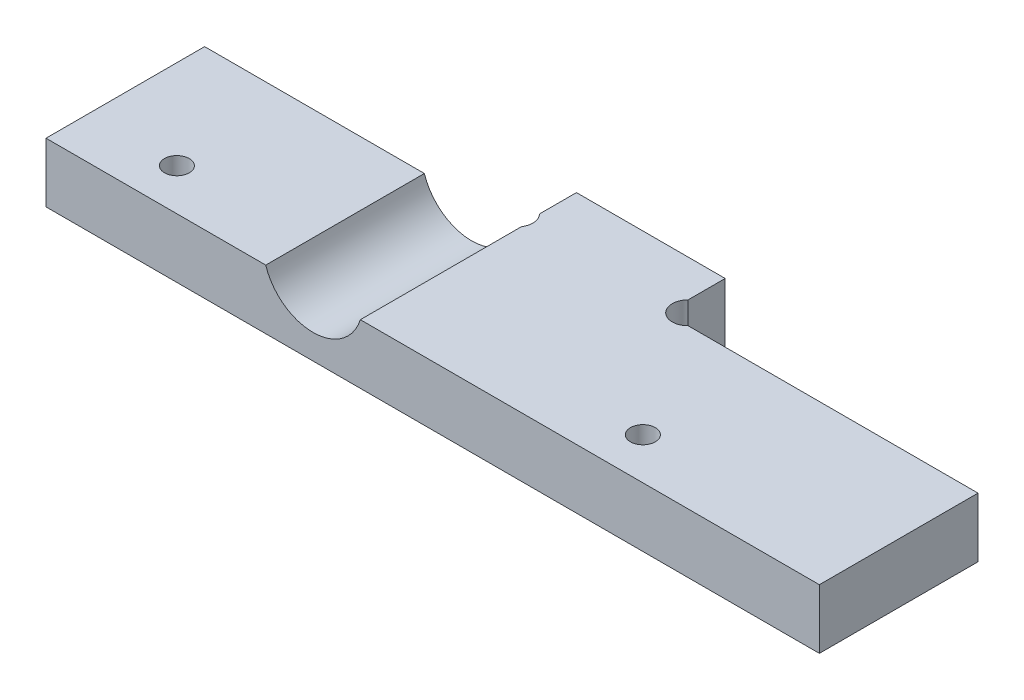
from build123d import *

# Parameters (mm, degrees)
ESQUISSE1_R             = 1.25
BOSS_EXTRU_1_DEPTH      = 6
ESQUISSE2_R             = 5
ENL_V_MAT_EXTRU_1_DEPTH = 16.5


with BuildPart() as part:
    # Esquisse1 → Boss.-Extru.1 (new body)
    with BuildSketch(Plane(origin=(0, 0, 0), x_dir=(1, 0, 0), z_dir=(0, 1, 0))):
        with BuildLine():
            Line((31.5, 18.2627417), (31.5, 22))
            Line((31.5, 22), (46.5, 22))
            Line((46.5, 22), (46.5, 18.2627417))
            ThreePointArc((46.5, 18.2627417), (46.5, 16), (48.7627417, 16))
            Line((48.7627417, 16), (78, 16))
            Line((78, 16), (78, 0))
            Line((78, 0), (0, 0))
            Line((0, 0), (0, 16))
            Line((0, 16), (29.2372583, 16))
            ThreePointArc((29.2372583, 16), (31.5, 16), (31.5, 18.2627417))
        make_face()
        with Locations(Location((56, 4.2, 0), (0, 0, 270))):
            Circle(ESQUISSE1_R, mode=Mode.SUBTRACT)
        with Locations(Location((9, 4.2, 0), (0, 0, 270))):
            Circle(ESQUISSE1_R, mode=Mode.SUBTRACT)
    extrude(amount=BOSS_EXTRU_1_DEPTH)

    # Esquisse2 → Enl_v. mat.-Extru.1 (cut)
    with BuildSketch(Plane.XY):
        with Locations((118.695192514, 7.5)):
            Circle(ESQUISSE2_R)
        with Locations((26.933800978, 7.5)):
            Circle(ESQUISSE2_R)
    extrude(amount=-ENL_V_MAT_EXTRU_1_DEPTH, mode=Mode.SUBTRACT)


solid = part.part
